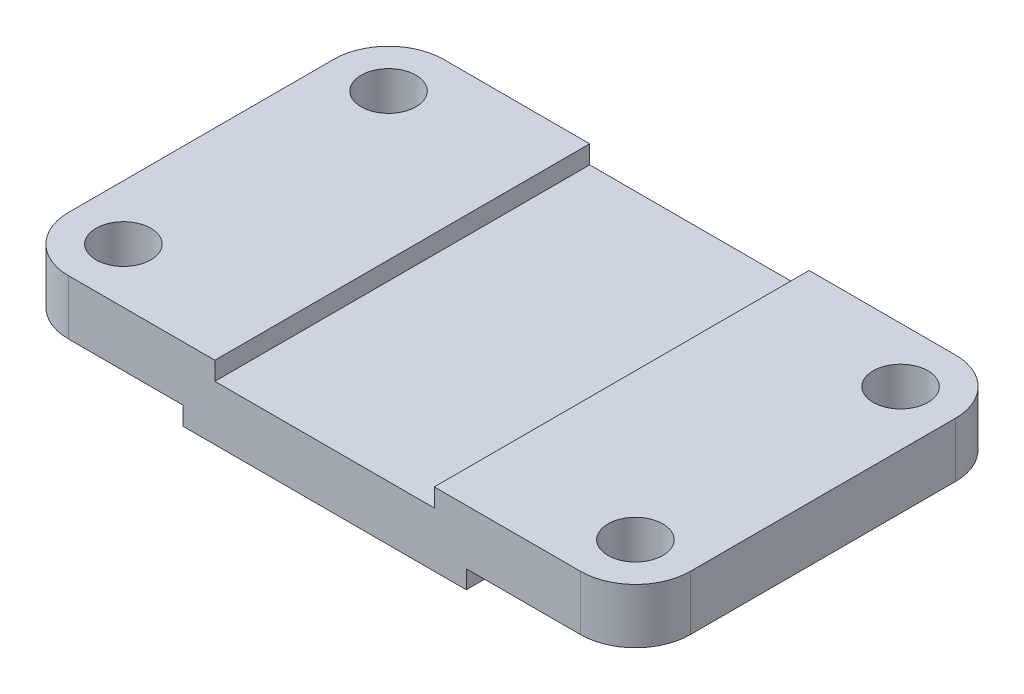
from build123d import *

# Parameters (mm, degrees)
BOSS_EXTRUDE1_DEPTH = 41
FILLET1_R           = 12
SKETCH2_R           = 6
CUT_EXTRUDE1_DEPTH  = 82


with BuildPart() as part:
    # Sketch1 → Boss-Extrude1 (new, symmetric)
    with BuildSketch(Plane.XY):
        Polygon((-31, 0), (31, 0), (31, 4), (68, 4), (68, 16), (24, 16), (24, 12), (-24, 12), (-24, 16), (-68, 16), (-68, 4), (-31, 4), align=None)
    extrude(amount=BOSS_EXTRUDE1_DEPTH, both=True)

    # Fillet1
    fillet1_edges = [part.edges().sort_by_distance(p)[0] for p in [
        (-68, 10, -41),
        (68, 10, -41),
        (68, 10, 41),
        (-68, 10, 41),
    ]]
    fillet(fillet1_edges, radius=FILLET1_R)

    # Sketch2 → Cut-Extrude1 (cut)
    with BuildSketch(Plane(origin=(0, 16, 0), x_dir=(1, 0, 0), z_dir=(0, 1, 0))):
        with Locations(Location((-56, 29, 0), (0, 0, 180))):
            Circle(SKETCH2_R)
        with Locations(Location((56, 29, 0), (0, 0, 180))):
            Circle(SKETCH2_R)
        with Locations(Location((56, -29, 0), (0, 0, 180))):
            Circle(SKETCH2_R)
        with Locations(Location((-56, -29, 0), (0, 0, 180))):
            Circle(SKETCH2_R)
    extrude(amount=-CUT_EXTRUDE1_DEPTH, mode=Mode.SUBTRACT)


solid = part.part
